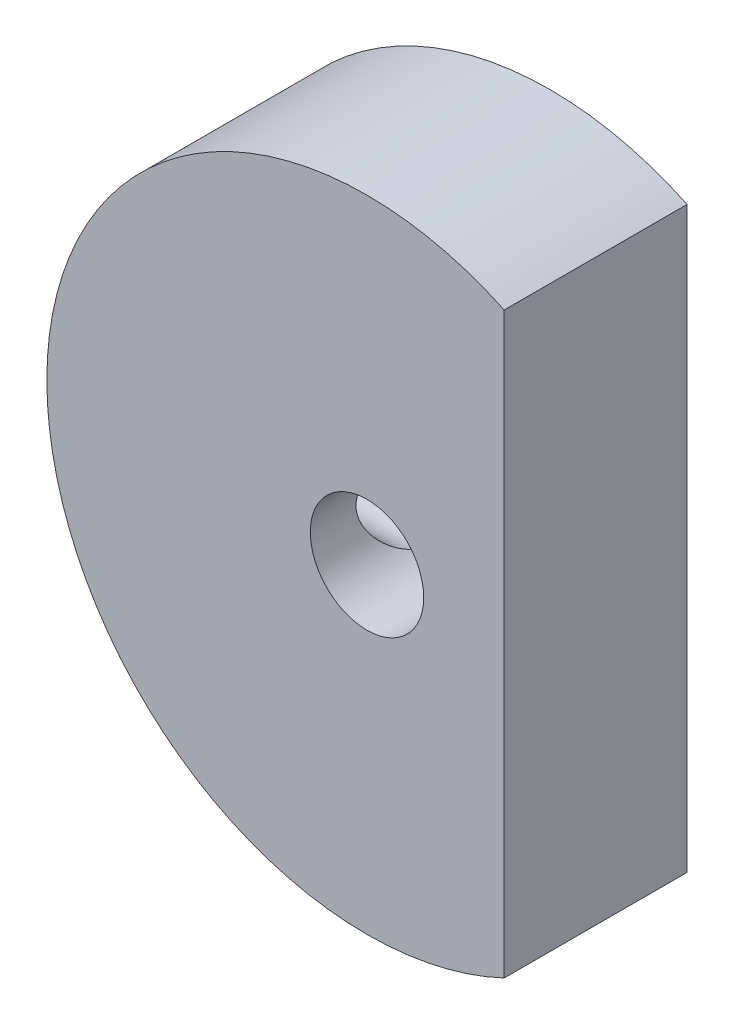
ISO-10303-21;
HEADER;
FILE_DESCRIPTION(('STEP AP214'),'2;1');
FILE_NAME('part.step','',(''),(''),'','','');
FILE_SCHEMA(('AUTOMOTIVE_DESIGN { 1 0 10303 214 1 1 1 1 }'));
ENDSEC;
DATA;
#1=APPLICATION_CONTEXT('core data for automotive mechanical design processes');
#2=APPLICATION_PROTOCOL_DEFINITION('international standard','automotive_design',2000,#1);
#3=PRODUCT_CONTEXT('',#1,'mechanical');
#4=PRODUCT('Part','Part','',(#3));
#5=PRODUCT_RELATED_PRODUCT_CATEGORY('part','',(#4));
#6=PRODUCT_DEFINITION_FORMATION('','',#4);
#7=PRODUCT_DEFINITION_CONTEXT('part definition',#1,'design');
#8=PRODUCT_DEFINITION('design','',#6,#7);
#9=PRODUCT_DEFINITION_SHAPE('','',#8);
#10=(LENGTH_UNIT() NAMED_UNIT(*) SI_UNIT(.MILLI.,.METRE.));
#11=(NAMED_UNIT(*) PLANE_ANGLE_UNIT() SI_UNIT($,.RADIAN.));
#12=(NAMED_UNIT(*) SI_UNIT($,.STERADIAN.) SOLID_ANGLE_UNIT());
#13=UNCERTAINTY_MEASURE_WITH_UNIT(LENGTH_MEASURE(1.E-05),#10,'distance_accuracy_value','');
#14=(GEOMETRIC_REPRESENTATION_CONTEXT(3) GLOBAL_UNCERTAINTY_ASSIGNED_CONTEXT((#13)) GLOBAL_UNIT_ASSIGNED_CONTEXT((#10,
#11,#12)) REPRESENTATION_CONTEXT('',''));
#15=CARTESIAN_POINT('',(0.,0.,0.));
#16=DIRECTION('',(0.,0.,1.));
#17=DIRECTION('',(1.,0.,0.));
#18=AXIS2_PLACEMENT_3D('',#15,#16,#17);
#19=CARTESIAN_POINT('',(0.,0.,5.));
#20=DIRECTION('',(0.,0.,1.));
#21=DIRECTION('',(1.,0.,0.));
#22=AXIS2_PLACEMENT_3D('',#19,#20,#21);
#23=PLANE('',#22);
#24=CARTESIAN_POINT('',(0.,0.,5.));
#25=DIRECTION('',(0.,0.,1.));
#26=DIRECTION('',(1.,0.,0.));
#27=AXIS2_PLACEMENT_3D('',#24,#25,#26);
#28=CIRCLE('',#27,17.5);
#29=CARTESIAN_POINT('',(7.5,15.8113883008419,5.));
#30=VERTEX_POINT('',#29);
#31=CARTESIAN_POINT('',(7.5,-15.8113883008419,5.));
#32=VERTEX_POINT('',#31);
#33=EDGE_CURVE('E121',#30,#32,#28,.T.);
#34=ORIENTED_EDGE('',*,*,#33,.T.);
#35=DIRECTION('',(0.,1.,0.));
#36=VECTOR('',#35,1.);
#37=CARTESIAN_POINT('',(7.5,15.8113883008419,5.));
#38=LINE('',#37,#36);
#39=EDGE_CURVE('E61',#32,#30,#38,.T.);
#40=ORIENTED_EDGE('',*,*,#39,.T.);
#41=EDGE_LOOP('',(#34,#40));
#42=FACE_BOUND('',#41,.T.);
#43=CARTESIAN_POINT('',(0.,0.,5.));
#44=DIRECTION('',(0.,0.,1.));
#45=DIRECTION('',(1.,0.,0.));
#46=AXIS2_PLACEMENT_3D('',#43,#44,#45);
#47=CIRCLE('',#46,3.1);
#48=CARTESIAN_POINT('',(3.1,0.,5.));
#49=VERTEX_POINT('',#48);
#50=EDGE_CURVE('E83',#49,#49,#47,.T.);
#51=ORIENTED_EDGE('',*,*,#50,.F.);
#52=EDGE_LOOP('',(#51));
#53=FACE_BOUND('',#52,.T.);
#54=ADVANCED_FACE('F38',(#42,#53),#23,.T.);
#55=CARTESIAN_POINT('',(0.,0.,-5.));
#56=DIRECTION('',(0.,0.,1.));
#57=DIRECTION('',(1.,0.,0.));
#58=AXIS2_PLACEMENT_3D('',#55,#56,#57);
#59=PLANE('',#58);
#60=CARTESIAN_POINT('',(0.,0.,-5.));
#61=DIRECTION('',(0.,0.,1.));
#62=DIRECTION('',(1.,0.,0.));
#63=AXIS2_PLACEMENT_3D('',#60,#61,#62);
#64=CIRCLE('',#63,17.5);
#65=CARTESIAN_POINT('',(7.5,15.8113883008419,-5.));
#66=VERTEX_POINT('',#65);
#67=CARTESIAN_POINT('',(7.5,-15.8113883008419,-5.));
#68=VERTEX_POINT('',#67);
#69=EDGE_CURVE('E122',#66,#68,#64,.T.);
#70=ORIENTED_EDGE('',*,*,#69,.F.);
#71=DIRECTION('',(0.,1.,0.));
#72=VECTOR('',#71,1.);
#73=CARTESIAN_POINT('',(7.5,15.8113883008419,-5.));
#74=LINE('',#73,#72);
#75=EDGE_CURVE('E114',#68,#66,#74,.T.);
#76=ORIENTED_EDGE('',*,*,#75,.F.);
#77=EDGE_LOOP('',(#70,#76));
#78=FACE_BOUND('',#77,.T.);
#79=CARTESIAN_POINT('',(0.,0.,-5.));
#80=DIRECTION('',(0.,0.,1.));
#81=DIRECTION('',(1.,0.,0.));
#82=AXIS2_PLACEMENT_3D('',#79,#80,#81);
#83=CIRCLE('',#82,3.1);
#84=CARTESIAN_POINT('',(3.1,0.,-5.));
#85=VERTEX_POINT('',#84);
#86=EDGE_CURVE('E80',#85,#85,#83,.T.);
#87=ORIENTED_EDGE('',*,*,#86,.T.);
#88=EDGE_LOOP('',(#87));
#89=FACE_BOUND('',#88,.T.);
#90=ADVANCED_FACE('F104',(#78,#89),#59,.F.);
#91=CARTESIAN_POINT('',(0.,0.,5.));
#92=DIRECTION('',(0.,0.,-1.));
#93=DIRECTION('',(-1.,0.,0.));
#94=AXIS2_PLACEMENT_3D('',#91,#92,#93);
#95=CYLINDRICAL_SURFACE('',#94,17.5);
#96=CARTESIAN_POINT('',(-17.5,0.,2.49999999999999));
#97=CARTESIAN_POINT('',(-17.4999978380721,-0.139663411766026,2.49999418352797));
#98=CARTESIAN_POINT('',(-17.4983105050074,-0.279409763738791,2.48825698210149));
#99=CARTESIAN_POINT('',(-17.4917417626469,-0.5550016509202,2.44162715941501));
#100=CARTESIAN_POINT('',(-17.4868571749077,-0.690843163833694,2.40671149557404));
#101=CARTESIAN_POINT('',(-17.4744432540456,-0.954596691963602,2.31478484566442));
#102=CARTESIAN_POINT('',(-17.4669158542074,-1.08251442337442,2.25779000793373));
#103=CARTESIAN_POINT('',(-17.4500497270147,-1.32694912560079,2.1233611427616));
#104=CARTESIAN_POINT('',(-17.4407112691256,-1.44346778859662,2.04593015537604));
#105=CARTESIAN_POINT('',(-17.4211884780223,-1.66264662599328,1.87223957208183));
#106=CARTESIAN_POINT('',(-17.4109991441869,-1.76521397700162,1.77586339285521));
#107=CARTESIAN_POINT('',(-17.3909624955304,-1.95277822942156,1.56726896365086));
#108=CARTESIAN_POINT('',(-17.3811151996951,-2.03777415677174,1.45504983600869));
#109=CARTESIAN_POINT('',(-17.3628289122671,-2.18813969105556,1.21733720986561));
#110=CARTESIAN_POINT('',(-17.3543963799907,-2.2534203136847,1.09178688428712));
#111=CARTESIAN_POINT('',(-17.3399620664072,-2.36193362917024,0.83136365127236));
#112=CARTESIAN_POINT('',(-17.3339601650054,-2.40516741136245,0.696491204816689));
#113=CARTESIAN_POINT('',(-17.3251154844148,-2.46807330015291,0.422224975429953));
#114=CARTESIAN_POINT('',(-17.3222514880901,-2.48790372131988,0.282868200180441));
#115=CARTESIAN_POINT('',(-17.3199423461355,-2.5039302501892,0.00277773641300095));
#116=CARTESIAN_POINT('',(-17.320497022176,-2.50012759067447,-0.137955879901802));
#117=CARTESIAN_POINT('',(-17.3249431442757,-2.46912545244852,-0.415691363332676));
#118=CARTESIAN_POINT('',(-17.328809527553,-2.44210170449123,-0.552713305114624));
#119=CARTESIAN_POINT('',(-17.3394042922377,-2.36569930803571,-0.820257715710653));
#120=CARTESIAN_POINT('',(-17.3461327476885,-2.31632008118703,-0.950780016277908));
#121=CARTESIAN_POINT('',(-17.361721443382,-2.19642380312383,-1.20215818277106));
#122=CARTESIAN_POINT('',(-17.3705892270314,-2.12583173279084,-1.3229777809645));
#123=CARTESIAN_POINT('',(-17.3894518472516,-1.96556711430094,-1.55112303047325));
#124=CARTESIAN_POINT('',(-17.3994467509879,-1.87589342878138,-1.65844787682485));
#125=CARTESIAN_POINT('',(-17.4195483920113,-1.67904364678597,-1.85757600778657));
#126=CARTESIAN_POINT('',(-17.4296553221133,-1.57171634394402,-1.94922986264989));
#127=CARTESIAN_POINT('',(-17.4487579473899,-1.34312289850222,-2.11324625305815));
#128=CARTESIAN_POINT('',(-17.4577536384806,-1.22185670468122,-2.18560871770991));
#129=CARTESIAN_POINT('',(-17.4736283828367,-0.968702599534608,-2.30899359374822));
#130=CARTESIAN_POINT('',(-17.4805063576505,-0.836809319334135,-2.36000513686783));
#131=CARTESIAN_POINT('',(-17.4913614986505,-0.566208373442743,-2.43911367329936));
#132=CARTESIAN_POINT('',(-17.4953388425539,-0.427501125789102,-2.46721207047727));
#133=CARTESIAN_POINT('',(-17.4999211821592,-0.148500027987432,-2.49949953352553));
#134=CARTESIAN_POINT('',(-17.500555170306,-0.00823042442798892,-2.50389415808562));
#135=CARTESIAN_POINT('',(-17.4984580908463,0.271043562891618,-2.48919398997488));
#136=CARTESIAN_POINT('',(-17.4957271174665,0.410047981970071,-2.47009985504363));
#137=CARTESIAN_POINT('',(-17.4872249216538,0.682228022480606,-2.4091350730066));
#138=CARTESIAN_POINT('',(-17.4814669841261,0.815426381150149,-2.36736392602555));
#139=CARTESIAN_POINT('',(-17.4675546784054,1.07292868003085,-2.26233532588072));
#140=CARTESIAN_POINT('',(-17.4594002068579,1.19723223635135,-2.19907694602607));
#141=CARTESIAN_POINT('',(-17.4415297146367,1.43432461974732,-2.05238272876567));
#142=CARTESIAN_POINT('',(-17.4318036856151,1.54703151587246,-1.96881571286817));
#143=CARTESIAN_POINT('',(-17.4119055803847,1.75689411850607,-1.78405990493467));
#144=CARTESIAN_POINT('',(-17.4017334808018,1.85404900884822,-1.68287018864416));
#145=CARTESIAN_POINT('',(-17.3819985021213,2.03079205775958,-1.46482912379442));
#146=CARTESIAN_POINT('',(-17.3724407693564,2.11024287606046,-1.34786591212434));
#147=CARTESIAN_POINT('',(-17.3551058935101,2.24836960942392,-1.102133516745));
#148=CARTESIAN_POINT('',(-17.3473287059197,2.30704604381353,-0.973364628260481));
#149=CARTESIAN_POINT('',(-17.334472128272,2.40174263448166,-0.708095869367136));
#150=CARTESIAN_POINT('',(-17.3293839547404,2.43783662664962,-0.571622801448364));
#151=CARTESIAN_POINT('',(-17.3224576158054,2.48657966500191,-0.294474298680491));
#152=CARTESIAN_POINT('',(-17.3206192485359,2.49923016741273,-0.153799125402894));
#153=CARTESIAN_POINT('',(-17.3204077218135,2.50069487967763,0.126392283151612));
#154=CARTESIAN_POINT('',(-17.3220031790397,2.48972496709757,0.265907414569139));
#155=CARTESIAN_POINT('',(-17.3284115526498,2.44472119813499,0.541087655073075));
#156=CARTESIAN_POINT('',(-17.3332244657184,2.41068736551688,0.676752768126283));
#157=CARTESIAN_POINT('',(-17.3455148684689,2.32059556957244,0.940331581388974));
#158=CARTESIAN_POINT('',(-17.3529907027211,2.26455128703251,1.0682500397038));
#159=CARTESIAN_POINT('',(-17.3697668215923,2.13205080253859,1.31290305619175));
#160=CARTESIAN_POINT('',(-17.3790671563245,2.05559403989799,1.42963730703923));
#161=CARTESIAN_POINT('',(-17.3985457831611,1.88364934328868,1.64970727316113));
#162=CARTESIAN_POINT('',(-17.4087310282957,1.78800116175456,1.75291718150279));
#163=CARTESIAN_POINT('',(-17.4287727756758,1.58072689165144,1.94189963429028));
#164=CARTESIAN_POINT('',(-17.4386292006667,1.46909708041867,2.02766810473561));
#165=CARTESIAN_POINT('',(-17.456958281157,1.23237928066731,2.17970946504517));
#166=CARTESIAN_POINT('',(-17.4654238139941,1.10722714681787,2.24588331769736));
#167=CARTESIAN_POINT('',(-17.4799469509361,0.847526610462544,2.35617468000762));
#168=CARTESIAN_POINT('',(-17.4860070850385,0.712988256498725,2.40031537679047));
#169=CARTESIAN_POINT('',(-17.4936295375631,0.481514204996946,2.45510448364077));
#170=CARTESIAN_POINT('',(-17.4960063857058,0.386017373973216,2.4719150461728));
#171=CARTESIAN_POINT('',(-17.4991923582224,0.193693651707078,2.49436476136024));
#172=CARTESIAN_POINT('',(-17.5000014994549,0.096866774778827,2.50000403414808));
#173=CARTESIAN_POINT('',(-17.5,0.,2.49999999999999));
#174=B_SPLINE_CURVE_WITH_KNOTS('',3,(#96,#97,#98,#99,#100,#101,#102,#103,#104,#105,#106,#107,
#108,#109,#110,#111,#112,#113,#114,#115,#116,#117,#118,#119,#120,#121,#122,#123,#124,#125,#126,
#127,#128,#129,#130,#131,#132,#133,#134,#135,#136,#137,#138,#139,#140,#141,#142,#143,#144,#145,
#146,#147,#148,#149,#150,#151,#152,#153,#154,#155,#156,#157,#158,#159,#160,#161,#162,#163,#164,
#165,#166,#167,#168,#169,#170,#171,#172,#173),.UNSPECIFIED.,.T.,.F.,(4,2,2,2,2,2,2,2,2,2,2,2,2,
2,2,2,2,2,2,2,2,2,2,2,2,2,2,2,2,2,2,2,2,2,2,2,2,2,4),(0.,0.418636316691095,0.837689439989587,
1.25643665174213,1.67512160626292,2.09646858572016,2.51783891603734,2.94108360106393,
3.36430737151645,3.78465148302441,4.20497366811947,4.6221427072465,5.03932253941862,
5.45799544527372,5.87669331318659,6.29918445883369,6.72167715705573,7.14438465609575,
7.56706625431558,7.98607640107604,8.40507481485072,8.82224947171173,9.23944212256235,
9.65940469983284,10.0793893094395,10.5025265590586,10.9256532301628,11.3473891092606,
11.7690987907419,12.186970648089,12.6048420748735,13.0224541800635,13.4400777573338,
13.8613455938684,14.2827117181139,14.7061725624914,15.1291868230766,15.419544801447,
15.7098996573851),.UNSPECIFIED.);
#175=CARTESIAN_POINT('',(-17.5,0.,-2.49999999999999));
#176=VERTEX_POINT('',#175);
#177=CARTESIAN_POINT('',(-17.5,0.,2.49999999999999));
#178=VERTEX_POINT('',#177);
#179=EDGE_CURVE('E72',#176,#178,#174,.T.);
#180=ORIENTED_EDGE('',*,*,#179,.T.);
#181=EDGE_CURVE('E54',#178,#176,#174,.T.);
#182=ORIENTED_EDGE('',*,*,#181,.T.);
#183=EDGE_LOOP('',(#180,#182));
#184=FACE_BOUND('',#183,.T.);
#185=ORIENTED_EDGE('',*,*,#69,.T.);
#186=DIRECTION('',(0.,0.,-1.));
#187=VECTOR('',#186,1.);
#188=CARTESIAN_POINT('',(7.5,-15.8113883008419,5.));
#189=LINE('',#188,#187);
#190=EDGE_CURVE('E11',#32,#68,#189,.T.);
#191=ORIENTED_EDGE('',*,*,#190,.F.);
#192=ORIENTED_EDGE('',*,*,#33,.F.);
#193=DIRECTION('',(0.,0.,-1.));
#194=VECTOR('',#193,1.);
#195=CARTESIAN_POINT('',(7.5,15.8113883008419,5.));
#196=LINE('',#195,#194);
#197=EDGE_CURVE('E48',#30,#66,#196,.T.);
#198=ORIENTED_EDGE('',*,*,#197,.T.);
#199=EDGE_LOOP('',(#185,#191,#192,#198));
#200=FACE_BOUND('',#199,.T.);
#201=ADVANCED_FACE('F40',(#184,#200),#95,.T.);
#202=CARTESIAN_POINT('',(7.5,15.8113883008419,5.));
#203=DIRECTION('',(-1.,0.,0.));
#204=DIRECTION('',(0.,-1.,0.));
#205=AXIS2_PLACEMENT_3D('',#202,#203,#204);
#206=PLANE('',#205);
#207=ORIENTED_EDGE('',*,*,#75,.T.);
#208=ORIENTED_EDGE('',*,*,#197,.F.);
#209=ORIENTED_EDGE('',*,*,#39,.F.);
#210=ORIENTED_EDGE('',*,*,#190,.T.);
#211=EDGE_LOOP('',(#207,#208,#209,#210));
#212=FACE_BOUND('',#211,.T.);
#213=ADVANCED_FACE('F102',(#212),#206,.F.);
#214=CARTESIAN_POINT('',(0.,0.,5.));
#215=DIRECTION('',(0.,0.,-1.));
#216=DIRECTION('',(-1.,0.,0.));
#217=AXIS2_PLACEMENT_3D('',#214,#215,#216);
#218=CYLINDRICAL_SURFACE('',#217,3.1);
#219=CARTESIAN_POINT('',(-3.1,0.,2.49999999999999));
#220=CARTESIAN_POINT('',(-3.09999001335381,-0.119778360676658,2.49998971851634));
#221=CARTESIAN_POINT('',(-3.09298899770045,-0.239689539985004,2.49132259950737));
#222=CARTESIAN_POINT('',(-3.06560951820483,-0.475617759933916,2.45724645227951));
#223=CARTESIAN_POINT('',(-3.04520791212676,-0.591627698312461,2.43180846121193));
#224=CARTESIAN_POINT('',(-2.9929494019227,-0.815730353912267,2.36603936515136));
#225=CARTESIAN_POINT('',(-2.96116388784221,-0.923867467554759,2.32580103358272));
#226=CARTESIAN_POINT('',(-2.88841373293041,-1.13099059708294,2.23243967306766));
#227=CARTESIAN_POINT('',(-2.84744794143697,-1.22997546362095,2.17931502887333));
#228=CARTESIAN_POINT('',(-2.74309892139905,-1.45090450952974,2.04139671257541));
#229=CARTESIAN_POINT('',(-2.67690087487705,-1.56866360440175,1.95203816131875));
#230=CARTESIAN_POINT('',(-2.53775821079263,-1.78504042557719,1.75642105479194));
#231=CARTESIAN_POINT('',(-2.46479460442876,-1.88360171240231,1.65011429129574));
#232=CARTESIAN_POINT('',(-2.35456527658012,-2.01728696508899,1.47848368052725));
#233=CARTESIAN_POINT('',(-2.31738149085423,-2.05977934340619,1.41870007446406));
#234=CARTESIAN_POINT('',(-2.24389548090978,-2.13959589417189,1.29519889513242));
#235=CARTESIAN_POINT('',(-2.20759354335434,-2.17691840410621,1.23148006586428));
#236=CARTESIAN_POINT('',(-2.13716872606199,-2.24609423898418,1.10024873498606));
#237=CARTESIAN_POINT('',(-2.10304023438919,-2.27796204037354,1.03274692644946));
#238=CARTESIAN_POINT('',(-2.03837958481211,-2.33599958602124,0.89374161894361));
#239=CARTESIAN_POINT('',(-2.00784434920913,-2.36217422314,0.822241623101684));
#240=CARTESIAN_POINT('',(-1.94837498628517,-2.41154065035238,0.664956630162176));
#241=CARTESIAN_POINT('',(-1.92024755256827,-2.43381803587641,0.578564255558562));
#242=CARTESIAN_POINT('',(-1.87451159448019,-2.46922213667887,0.401332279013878));
#243=CARTESIAN_POINT('',(-1.85687697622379,-2.48237156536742,0.310504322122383));
#244=CARTESIAN_POINT('',(-1.83500569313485,-2.49859247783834,0.125382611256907));
#245=CARTESIAN_POINT('',(-1.83089546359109,-2.50156886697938,0.03106444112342));
#246=CARTESIAN_POINT('',(-1.83732153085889,-2.49684928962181,-0.15682594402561));
#247=CARTESIAN_POINT('',(-1.84786859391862,-2.4891454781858,-0.25039755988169));
#248=CARTESIAN_POINT('',(-1.88391546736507,-2.46199489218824,-0.447022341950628));
#249=CARTESIAN_POINT('',(-1.91135892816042,-2.44100955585,-0.549487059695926));
#250=CARTESIAN_POINT('',(-1.97745021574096,-2.38777531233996,-0.747755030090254));
#251=CARTESIAN_POINT('',(-2.01613187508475,-2.35549233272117,-0.843537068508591));
#252=CARTESIAN_POINT('',(-2.08976487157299,-2.29012853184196,-1.00546278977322));
#253=CARTESIAN_POINT('',(-2.12332131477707,-2.25916672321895,-1.07313333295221));
#254=CARTESIAN_POINT('',(-2.19268911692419,-2.19190662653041,-1.20457297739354));
#255=CARTESIAN_POINT('',(-2.22850156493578,-2.15560574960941,-1.2683401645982));
#256=CARTESIAN_POINT('',(-2.33752866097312,-2.03893319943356,-1.45401664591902));
#257=CARTESIAN_POINT('',(-2.41230832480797,-1.95081223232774,-1.57025070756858));
#258=CARTESIAN_POINT('',(-2.56083494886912,-1.7516011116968,-1.79012948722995));
#259=CARTESIAN_POINT('',(-2.63448052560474,-1.63989136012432,-1.89328097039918));
#260=CARTESIAN_POINT('',(-2.77154829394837,-1.395706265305,-2.07977172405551));
#261=CARTESIAN_POINT('',(-2.83499703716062,-1.2632866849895,-2.16316272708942));
#262=CARTESIAN_POINT('',(-2.92949524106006,-1.01979463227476,-2.28538194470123));
#263=CARTESIAN_POINT('',(-2.96463246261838,-0.913281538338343,-2.33014295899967));
#264=CARTESIAN_POINT('',(-3.0238656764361,-0.692299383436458,-2.40505608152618));
#265=CARTESIAN_POINT('',(-3.04796987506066,-0.577836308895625,-2.43521904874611));
#266=CARTESIAN_POINT('',(-3.0832454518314,-0.343140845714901,-2.47922918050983));
#267=CARTESIAN_POINT('',(-3.09434390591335,-0.222879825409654,-2.49298435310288));
#268=CARTESIAN_POINT('',(-3.1022974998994,0.0188325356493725,-2.50285038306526));
#269=CARTESIAN_POINT('',(-3.09915629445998,0.140283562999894,-2.49896576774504));
#270=CARTESIAN_POINT('',(-3.07985111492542,0.369592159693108,-2.47497973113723));
#271=CARTESIAN_POINT('',(-3.06485327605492,0.477707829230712,-2.4563302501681));
#272=CARTESIAN_POINT('',(-3.02443626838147,0.688719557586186,-2.40571120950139));
#273=CARTESIAN_POINT('',(-2.99901424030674,0.791614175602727,-2.37373799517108));
#274=CARTESIAN_POINT('',(-2.93781657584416,0.995582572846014,-2.29594741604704));
#275=CARTESIAN_POINT('',(-2.90155557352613,1.09625730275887,-2.24947515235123));
#276=CARTESIAN_POINT('',(-2.82155077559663,1.28828745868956,-2.14528835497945));
#277=CARTESIAN_POINT('',(-2.77780631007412,1.37964204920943,-2.08757281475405));
#278=CARTESIAN_POINT('',(-2.67639841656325,1.56857510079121,-1.95079494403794));
#279=CARTESIAN_POINT('',(-2.61766035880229,1.66413998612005,-1.86975889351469));
#280=CARTESIAN_POINT('',(-2.49626806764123,1.84124673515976,-1.69566732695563));
#281=CARTESIAN_POINT('',(-2.43360410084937,1.92275170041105,-1.60258127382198));
#282=CARTESIAN_POINT('',(-2.33292149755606,2.04230195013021,-1.44383811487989));
#283=CARTESIAN_POINT('',(-2.2948094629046,2.08491031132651,-1.38161803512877));
#284=CARTESIAN_POINT('',(-2.21975309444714,2.16464553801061,-1.25301193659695));
#285=CARTESIAN_POINT('',(-2.18280935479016,2.20176964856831,-1.18662384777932));
#286=CARTESIAN_POINT('',(-2.11156599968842,2.27018074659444,-1.04981522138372));
#287=CARTESIAN_POINT('',(-2.07725930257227,2.30148371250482,-0.979406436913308));
#288=CARTESIAN_POINT('',(-2.01293979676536,2.35794450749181,-0.834354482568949));
#289=CARTESIAN_POINT('',(-1.98292225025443,2.38310913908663,-0.759716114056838));
#290=CARTESIAN_POINT('',(-1.92703802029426,2.42856624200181,-0.599631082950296));
#291=CARTESIAN_POINT('',(-1.90174280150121,2.44826102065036,-0.513805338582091));
#292=CARTESIAN_POINT('',(-1.86203047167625,2.47860518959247,-0.338244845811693));
#293=CARTESIAN_POINT('',(-1.84758432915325,2.48927872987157,-0.248521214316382));
#294=CARTESIAN_POINT('',(-1.83198973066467,2.50078489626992,-0.0665425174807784));
#295=CARTESIAN_POINT('',(-1.83094108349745,2.50154366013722,0.0257264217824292));
#296=CARTESIAN_POINT('',(-1.84262322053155,2.49294583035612,0.208953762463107));
#297=CARTESIAN_POINT('',(-1.85537127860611,2.48357655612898,0.299910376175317));
#298=CARTESIAN_POINT('',(-1.89618640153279,2.45259921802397,0.496668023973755));
#299=CARTESIAN_POINT('',(-1.92691938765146,2.42882492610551,0.60154898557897));
#300=CARTESIAN_POINT('',(-1.99936028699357,2.36954227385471,0.804037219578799));
#301=CARTESIAN_POINT('',(-2.04110111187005,2.3339986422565,0.901621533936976));
#302=CARTESIAN_POINT('',(-2.11940167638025,2.26278696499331,1.06566816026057));
#303=CARTESIAN_POINT('',(-2.15463003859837,2.22939184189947,1.1337917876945));
#304=CARTESIAN_POINT('',(-2.22703059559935,2.15707029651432,1.26598943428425));
#305=CARTESIAN_POINT('',(-2.26420367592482,2.11814134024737,1.33006157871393));
#306=CARTESIAN_POINT('',(-2.33930273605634,2.03489715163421,1.45422850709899));
#307=CARTESIAN_POINT('',(-2.37722927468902,1.99057778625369,1.51432018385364));
#308=CARTESIAN_POINT('',(-2.4528181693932,1.89666309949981,1.63041482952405));
#309=CARTESIAN_POINT('',(-2.49048037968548,1.84706507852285,1.6864156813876));
#310=CARTESIAN_POINT('',(-2.60338878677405,1.68802975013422,1.8504208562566));
#311=CARTESIAN_POINT('',(-2.6768933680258,1.57010426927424,1.9517903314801));
#312=CARTESIAN_POINT('',(-2.77806294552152,1.37755009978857,2.08770591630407));
#313=CARTESIAN_POINT('',(-2.81025494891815,1.31079924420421,2.13030055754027));
#314=CARTESIAN_POINT('',(-2.87080763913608,1.17224885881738,2.20956950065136));
#315=CARTESIAN_POINT('',(-2.8991704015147,1.1004520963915,2.2462470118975));
#316=CARTESIAN_POINT('',(-2.96115028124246,0.923785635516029,2.32577915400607));
#317=CARTESIAN_POINT('',(-2.99262693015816,0.816770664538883,2.36562957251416));
#318=CARTESIAN_POINT('',(-3.04428396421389,0.595924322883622,2.43064951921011));
#319=CARTESIAN_POINT('',(-3.06449047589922,0.482109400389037,2.45585300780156));
#320=CARTESIAN_POINT('',(-3.08545620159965,0.306066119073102,2.48194766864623));
#321=CARTESIAN_POINT('',(-3.09089438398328,0.245195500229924,2.48870157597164));
#322=CARTESIAN_POINT('',(-3.09816930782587,0.122895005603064,2.4977309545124));
#323=CARTESIAN_POINT('',(-3.1000051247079,0.061464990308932,2.50000527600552));
#324=CARTESIAN_POINT('',(-3.1,0.,2.49999999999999));
#325=B_SPLINE_CURVE_WITH_KNOTS('',3,(#219,#220,#221,#222,#223,#224,#225,#226,#227,#228,#229,
#230,#231,#232,#233,#234,#235,#236,#237,#238,#239,#240,#241,#242,#243,#244,#245,#246,#247,#248,
#249,#250,#251,#252,#253,#254,#255,#256,#257,#258,#259,#260,#261,#262,#263,#264,#265,#266,#267,
#268,#269,#270,#271,#272,#273,#274,#275,#276,#277,#278,#279,#280,#281,#282,#283,#284,#285,#286,
#287,#288,#289,#290,#291,#292,#293,#294,#295,#296,#297,#298,#299,#300,#301,#302,#303,#304,#305,
#306,#307,#308,#309,#310,#311,#312,#313,#314,#315,#316,#317,#318,#319,#320,#321,#322,#323,#324),
.UNSPECIFIED.,.T.,.F.,(4,2,2,2,2,2,2,2,2,2,2,2,2,2,2,2,2,2,2,2,2,2,2,2,2,2,2,2,2,2,2,2,2,2,2,2,
2,2,2,2,2,2,2,2,2,2,2,2,2,2,2,2,4),(0.,0.359070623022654,0.718762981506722,1.07623806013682,
1.43375797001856,1.91714127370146,2.40192490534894,2.64841768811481,2.89498955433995,
3.14089653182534,3.38659132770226,3.66629544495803,3.94530104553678,4.22690768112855,
4.50872127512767,4.83133279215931,5.15492577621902,5.39951634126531,5.64422589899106,
6.13382175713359,6.63837846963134,7.14159929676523,7.50245315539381,7.86303817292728,
8.22563548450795,8.58813973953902,8.91885561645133,9.24966226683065,9.59834994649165,
9.94706885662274,10.3607838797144,10.7755686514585,11.028808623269,11.2821753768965,
11.5348360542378,11.7872154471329,12.0610951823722,12.3342393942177,12.6094173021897,
12.8849401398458,13.2186306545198,13.5533303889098,13.8039756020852,14.0547359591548,
14.305689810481,14.5567726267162,15.0695565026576,15.3256405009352,15.5815851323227,
15.9354380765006,16.2884672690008,16.4726792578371,16.6569385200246),.UNSPECIFIED.);
#326=CARTESIAN_POINT('',(-3.1,0.,2.49999999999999));
#327=VERTEX_POINT('',#326);
#328=EDGE_CURVE('E76',#327,#327,#325,.T.);
#329=ORIENTED_EDGE('',*,*,#328,.F.);
#330=EDGE_LOOP('',(#329));
#331=FACE_BOUND('',#330,.T.);
#332=ORIENTED_EDGE('',*,*,#50,.T.);
#333=EDGE_LOOP('',(#332));
#334=FACE_BOUND('',#333,.T.);
#335=ORIENTED_EDGE('',*,*,#86,.F.);
#336=EDGE_LOOP('',(#335));
#337=FACE_BOUND('',#336,.T.);
#338=ADVANCED_FACE('F95',(#331,#334,#337),#218,.F.);
#339=CARTESIAN_POINT('',(-17.5,0.,0.));
#340=DIRECTION('',(-1.,0.,0.));
#341=DIRECTION('',(0.,0.,1.));
#342=AXIS2_PLACEMENT_3D('',#339,#340,#341);
#343=CYLINDRICAL_SURFACE('',#342,2.49999999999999);
#344=ORIENTED_EDGE('',*,*,#328,.T.);
#345=EDGE_LOOP('',(#344));
#346=FACE_BOUND('',#345,.T.);
#347=ORIENTED_EDGE('',*,*,#179,.F.);
#348=ORIENTED_EDGE('',*,*,#181,.F.);
#349=EDGE_LOOP('',(#347,#348));
#350=FACE_BOUND('',#349,.T.);
#351=ADVANCED_FACE('F73',(#346,#350),#343,.F.);
#352=CLOSED_SHELL('',(#54,#90,#201,#213,#338,#351));
#353=MANIFOLD_SOLID_BREP('B2',#352);
#354=ADVANCED_BREP_SHAPE_REPRESENTATION('',(#18,#353),#14);
#355=SHAPE_DEFINITION_REPRESENTATION(#9,#354);
ENDSEC;
END-ISO-10303-21;
